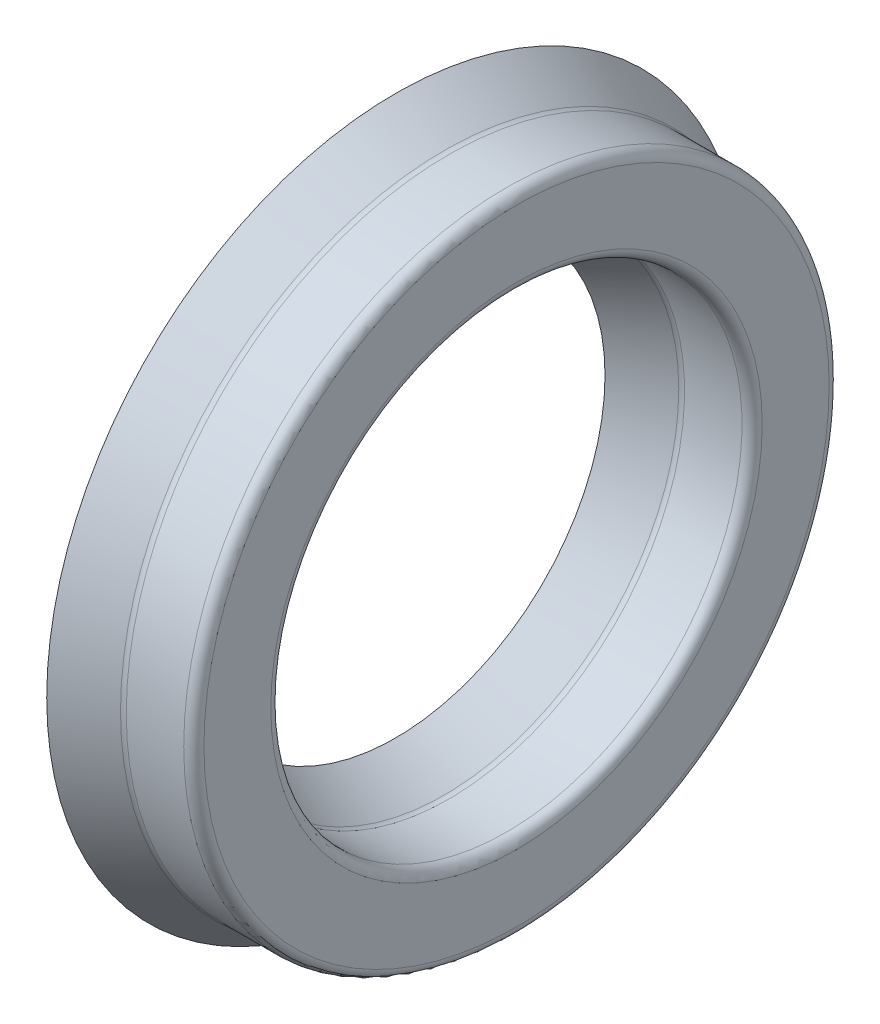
from build123d import *


with BuildPart() as part:
    # Sketch3 → Revolve1 (revolve)
    with BuildSketch(Plane.XY, mode=Mode.PRIVATE) as revolve1_sk:
        with BuildLine():
            Line((-1.161795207, 7.9375), (-0.054989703, 7.366200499))
            ThreePointArc((-0.054989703, 7.366200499), (-0.003816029, 7.347091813), (0.050421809, 7.3406))
            Line((0.050421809, 7.3406), (1.3576808, 7.3406))
            ThreePointArc((1.3576808, 7.3406), (1.520187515, 7.273287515), (1.5875, 7.1107808))
            Line((1.5875, 7.1107808), (1.5875, 5.5892192))
            ThreePointArc((1.5875, 5.5892192), (1.520187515, 5.426712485), (1.3576808, 5.3594))
            Line((1.3576808, 5.3594), (0.050421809, 5.3594))
            ThreePointArc((0.050421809, 5.3594), (-0.003816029, 5.352908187), (-0.054989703, 5.333799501))
            Line((-0.054989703, 5.333799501), (-1.161795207, 4.7625))
            Line((-1.161795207, 4.7625), (-1.5875, 5.587238))
            Line((-1.5875, 5.587238), (-0.505407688, 6.145781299))
            ThreePointArc((-0.505407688, 6.145781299), (-0.381, 6.35), (-0.505407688, 6.554218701))
            Line((-0.505407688, 6.554218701), (-1.5875, 7.112762))
            Line((-1.5875, 7.112762), (-1.161795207, 7.9375))
        make_face()
    revolve(revolve1_sk.sketch.rotate(Axis((-1.5875, 0, 0), (1, 0, 0)), 90), axis=Axis((-1.5875, 0, 0), (1, 0, 0)))


solid = part.part
